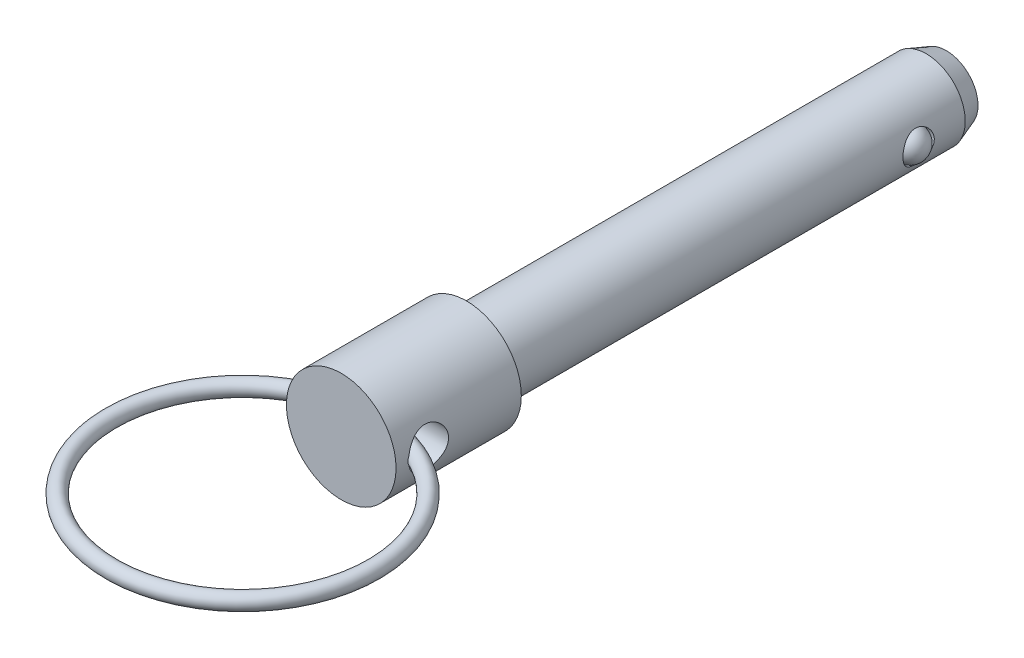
ISO-10303-21;
HEADER;
FILE_DESCRIPTION(('STEP AP214'),'2;1');
FILE_NAME('part.step','',(''),(''),'','','');
FILE_SCHEMA(('AUTOMOTIVE_DESIGN { 1 0 10303 214 1 1 1 1 }'));
ENDSEC;
DATA;
#1=APPLICATION_CONTEXT('core data for automotive mechanical design processes');
#2=APPLICATION_PROTOCOL_DEFINITION('international standard','automotive_design',2000,#1);
#3=PRODUCT_CONTEXT('',#1,'mechanical');
#4=PRODUCT('Part','Part','',(#3));
#5=PRODUCT_RELATED_PRODUCT_CATEGORY('part','',(#4));
#6=PRODUCT_DEFINITION_FORMATION('','',#4);
#7=PRODUCT_DEFINITION_CONTEXT('part definition',#1,'design');
#8=PRODUCT_DEFINITION('design','',#6,#7);
#9=PRODUCT_DEFINITION_SHAPE('','',#8);
#10=(LENGTH_UNIT() NAMED_UNIT(*) SI_UNIT(.MILLI.,.METRE.));
#11=(NAMED_UNIT(*) PLANE_ANGLE_UNIT() SI_UNIT($,.RADIAN.));
#12=(NAMED_UNIT(*) SI_UNIT($,.STERADIAN.) SOLID_ANGLE_UNIT());
#13=UNCERTAINTY_MEASURE_WITH_UNIT(LENGTH_MEASURE(1.E-05),#10,'distance_accuracy_value','');
#14=(GEOMETRIC_REPRESENTATION_CONTEXT(3) GLOBAL_UNCERTAINTY_ASSIGNED_CONTEXT((#13)) GLOBAL_UNIT_ASSIGNED_CONTEXT((#10,
#11,#12)) REPRESENTATION_CONTEXT('',''));
#15=CARTESIAN_POINT('',(0.,0.,0.));
#16=DIRECTION('',(0.,0.,1.));
#17=DIRECTION('',(1.,0.,0.));
#18=AXIS2_PLACEMENT_3D('',#15,#16,#17);
#19=CARTESIAN_POINT('',(7.9375,0.,9.398));
#20=DIRECTION('',(-1.,0.,0.));
#21=DIRECTION('',(0.,0.,-1.));
#22=AXIS2_PLACEMENT_3D('',#19,#20,#21);
#23=CYLINDRICAL_SURFACE('',#22,2.0193);
#24=CARTESIAN_POINT('',(-5.55645,0.413388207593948,11.3745329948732));
#25=CARTESIAN_POINT('',(-5.53323669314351,0.388835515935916,11.3796705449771));
#26=CARTESIAN_POINT('',(-5.51157389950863,0.362641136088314,11.3846690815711));
#27=CARTESIAN_POINT('',(-5.47216390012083,0.307044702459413,11.3940198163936));
#28=CARTESIAN_POINT('',(-5.45444977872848,0.277618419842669,11.3983664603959));
#29=CARTESIAN_POINT('',(-5.42406600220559,0.215851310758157,11.4059720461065));
#30=CARTESIAN_POINT('',(-5.41142802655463,0.18349367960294,11.4092241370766));
#31=CARTESIAN_POINT('',(-5.39235124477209,0.116986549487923,11.4141821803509));
#32=CARTESIAN_POINT('',(-5.38588919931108,0.0828442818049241,11.4158939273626));
#33=CARTESIAN_POINT('',(-5.37995615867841,0.017298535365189,11.4174656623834));
#34=CARTESIAN_POINT('',(-5.37986165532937,-0.0140451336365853,11.4174908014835));
#35=CARTESIAN_POINT('',(-5.38511249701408,-0.0762532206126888,11.4160995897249));
#36=CARTESIAN_POINT('',(-5.3904604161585,-0.107117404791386,11.4146825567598));
#37=CARTESIAN_POINT('',(-5.40574321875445,-0.165640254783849,11.4106965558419));
#38=CARTESIAN_POINT('',(-5.41539031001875,-0.193380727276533,11.408200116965));
#39=CARTESIAN_POINT('',(-5.43862859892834,-0.247073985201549,11.4023097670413));
#40=CARTESIAN_POINT('',(-5.45222392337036,-0.273024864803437,11.398914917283));
#41=CARTESIAN_POINT('',(-5.48024922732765,-0.318737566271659,11.3920973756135));
#42=CARTESIAN_POINT('',(-5.49418727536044,-0.338820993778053,11.3887682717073));
#43=CARTESIAN_POINT('',(-5.52397071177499,-0.37733037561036,11.3818282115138));
#44=CARTESIAN_POINT('',(-5.53980753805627,-0.395763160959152,11.378218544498));
#45=CARTESIAN_POINT('',(-5.55645,-0.413388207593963,11.3745329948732));
#46=B_SPLINE_CURVE_WITH_KNOTS('',3,(#24,#25,#26,#27,#28,#29,#30,#31,#32,#33,#34,#35,#36,#37,#38,
#39,#40,#41,#42,#43,#44,#45),.UNSPECIFIED.,.F.,.F.,(4,2,2,2,2,2,2,2,2,2,4),(0.,
0.102621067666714,0.206072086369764,0.310159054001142,0.413852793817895,0.50737645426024,
0.600944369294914,0.689017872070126,0.777183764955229,0.85106810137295,0.924630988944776),.UNSPECIFIED.);
#47=CARTESIAN_POINT('',(-5.54200209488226,0.397651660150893,11.3777589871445));
#48=VERTEX_POINT('',#47);
#49=CARTESIAN_POINT('',(-5.54200209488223,-0.397651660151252,11.3777589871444));
#50=VERTEX_POINT('',#49);
#51=EDGE_CURVE('E40',#48,#50,#46,.T.);
#52=ORIENTED_EDGE('',*,*,#51,.F.);
#53=CARTESIAN_POINT('',(-5.55625,0.,11.4173));
#54=CARTESIAN_POINT('',(-5.55624527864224,-0.109432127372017,11.4172937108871));
#55=CARTESIAN_POINT('',(-5.55298237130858,-0.218969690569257,11.408361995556));
#56=CARTESIAN_POINT('',(-5.54026368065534,-0.434902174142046,11.372953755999));
#57=CARTESIAN_POINT('',(-5.53079819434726,-0.541291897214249,11.3464497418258));
#58=CARTESIAN_POINT('',(-5.50670156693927,-0.747605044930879,11.2769560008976));
#59=CARTESIAN_POINT('',(-5.49208344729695,-0.847544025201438,11.2340078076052));
#60=CARTESIAN_POINT('',(-5.45915039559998,-1.03875753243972,11.1330083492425));
#61=CARTESIAN_POINT('',(-5.44083572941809,-1.13003268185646,11.0749581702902));
#62=CARTESIAN_POINT('',(-5.40158114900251,-1.30505728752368,10.9429422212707));
#63=CARTESIAN_POINT('',(-5.38056990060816,-1.38841141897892,10.8684736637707));
#64=CARTESIAN_POINT('',(-5.33865236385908,-1.54176439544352,10.7067995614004));
#65=CARTESIAN_POINT('',(-5.31774611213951,-1.61175885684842,10.6195898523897));
#66=CARTESIAN_POINT('',(-5.27759352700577,-1.73882919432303,10.4311528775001));
#67=CARTESIAN_POINT('',(-5.25843183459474,-1.79536185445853,10.3295394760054));
#68=CARTESIAN_POINT('',(-5.22503611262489,-1.89036141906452,10.1174402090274));
#69=CARTESIAN_POINT('',(-5.21080023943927,-1.92883508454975,10.0069576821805));
#70=CARTESIAN_POINT('',(-5.18962447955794,-1.98509166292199,9.78477737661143));
#71=CARTESIAN_POINT('',(-5.18242178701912,-2.00362275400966,9.67329490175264));
#72=CARTESIAN_POINT('',(-5.17535625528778,-2.02180769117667,9.44858805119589));
#73=CARTESIAN_POINT('',(-5.17549061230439,-2.02146874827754,9.33536435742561));
#74=CARTESIAN_POINT('',(-5.18285629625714,-2.00249790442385,9.11709454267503));
#75=CARTESIAN_POINT('',(-5.18969215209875,-1.98488533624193,9.01194405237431));
#76=CARTESIAN_POINT('',(-5.20903632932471,-1.93354575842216,8.80620743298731));
#77=CARTESIAN_POINT('',(-5.22154547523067,-1.89981640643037,8.70562196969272));
#78=CARTESIAN_POINT('',(-5.25107746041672,-1.81661001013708,8.5097235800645));
#79=CARTESIAN_POINT('',(-5.26817827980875,-1.76685762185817,8.41453987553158));
#80=CARTESIAN_POINT('',(-5.30493780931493,-1.65321144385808,8.23357336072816));
#81=CARTESIAN_POINT('',(-5.32459724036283,-1.58931366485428,8.14779321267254));
#82=CARTESIAN_POINT('',(-5.36576425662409,-1.44447059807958,7.98240722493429));
#83=CARTESIAN_POINT('',(-5.38731044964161,-1.36270785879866,7.90352531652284));
#84=CARTESIAN_POINT('',(-5.42876622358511,-1.18682967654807,7.76035905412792));
#85=CARTESIAN_POINT('',(-5.44867505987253,-1.09270866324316,7.69608131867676));
#86=CARTESIAN_POINT('',(-5.48497084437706,-0.893001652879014,7.58320896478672));
#87=CARTESIAN_POINT('',(-5.5013029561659,-0.787270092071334,7.53485348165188));
#88=CARTESIAN_POINT('',(-5.52817729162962,-0.568540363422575,7.45692936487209));
#89=CARTESIAN_POINT('',(-5.53873126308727,-0.455557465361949,7.4273225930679));
#90=CARTESIAN_POINT('',(-5.54924569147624,-0.284581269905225,7.39803699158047));
#91=CARTESIAN_POINT('',(-5.55186369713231,-0.227949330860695,7.3907957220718));
#92=CARTESIAN_POINT('',(-5.55536708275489,-0.114221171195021,7.3811255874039));
#93=CARTESIAN_POINT('',(-5.55625246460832,-0.0571249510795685,7.37869671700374));
#94=CARTESIAN_POINT('',(-5.55624527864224,0.10943212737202,7.37870628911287));
#95=CARTESIAN_POINT('',(-5.55298237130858,0.21896969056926,7.38763800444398));
#96=CARTESIAN_POINT('',(-5.54026368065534,0.434902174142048,7.42304624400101));
#97=CARTESIAN_POINT('',(-5.53079819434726,0.541291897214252,7.44955025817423));
#98=CARTESIAN_POINT('',(-5.50670156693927,0.747605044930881,7.51904399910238));
#99=CARTESIAN_POINT('',(-5.49208344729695,0.84754402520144,7.56199219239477));
#100=CARTESIAN_POINT('',(-5.45915039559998,1.03875753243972,7.66299165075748));
#101=CARTESIAN_POINT('',(-5.44083572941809,1.13003268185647,7.72104182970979));
#102=CARTESIAN_POINT('',(-5.40158114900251,1.30505728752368,7.85305777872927));
#103=CARTESIAN_POINT('',(-5.38056990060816,1.38841141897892,7.92752633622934));
#104=CARTESIAN_POINT('',(-5.33865236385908,1.54176439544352,8.08920043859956));
#105=CARTESIAN_POINT('',(-5.31774611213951,1.61175885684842,8.17641014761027));
#106=CARTESIAN_POINT('',(-5.27759352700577,1.73882919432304,8.36484712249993));
#107=CARTESIAN_POINT('',(-5.25843183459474,1.79536185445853,8.46646052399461));
#108=CARTESIAN_POINT('',(-5.22503611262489,1.89036141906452,8.67855979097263));
#109=CARTESIAN_POINT('',(-5.21080023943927,1.92883508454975,8.78904231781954));
#110=CARTESIAN_POINT('',(-5.18962447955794,1.98509166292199,9.01122262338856));
#111=CARTESIAN_POINT('',(-5.18242178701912,2.00362275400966,9.12270509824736));
#112=CARTESIAN_POINT('',(-5.17535625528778,2.02180769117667,9.34741194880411));
#113=CARTESIAN_POINT('',(-5.17549061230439,2.02146874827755,9.46063564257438));
#114=CARTESIAN_POINT('',(-5.18285629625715,2.00249790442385,9.67890545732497));
#115=CARTESIAN_POINT('',(-5.18969215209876,1.98488533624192,9.7840559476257));
#116=CARTESIAN_POINT('',(-5.20903632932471,1.93354575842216,9.98979256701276));
#117=CARTESIAN_POINT('',(-5.22154547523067,1.89981640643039,10.0903780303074));
#118=CARTESIAN_POINT('',(-5.25107746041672,1.81661001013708,10.2862764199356));
#119=CARTESIAN_POINT('',(-5.26817827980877,1.76685762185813,10.3814601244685));
#120=CARTESIAN_POINT('',(-5.30493780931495,1.65321144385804,10.5624266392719));
#121=CARTESIAN_POINT('',(-5.32459724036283,1.58931366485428,10.6482067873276));
#122=CARTESIAN_POINT('',(-5.36576425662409,1.44447059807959,10.8135927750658));
#123=CARTESIAN_POINT('',(-5.38731044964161,1.36270785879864,10.8924746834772));
#124=CARTESIAN_POINT('',(-5.42876622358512,1.18682967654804,11.0356409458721));
#125=CARTESIAN_POINT('',(-5.44867505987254,1.09270866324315,11.0999186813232));
#126=CARTESIAN_POINT('',(-5.48497084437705,0.89300165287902,11.2127910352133));
#127=CARTESIAN_POINT('',(-5.5013029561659,0.787270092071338,11.2611465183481));
#128=CARTESIAN_POINT('',(-5.52817729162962,0.56854036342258,11.3390706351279));
#129=CARTESIAN_POINT('',(-5.53873126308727,0.455557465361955,11.3686774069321));
#130=CARTESIAN_POINT('',(-5.54924569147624,0.284581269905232,11.3979630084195));
#131=CARTESIAN_POINT('',(-5.55186369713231,0.227949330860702,11.4052042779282));
#132=CARTESIAN_POINT('',(-5.55536708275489,0.114221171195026,11.4148744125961));
#133=CARTESIAN_POINT('',(-5.55625246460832,0.0571249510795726,11.4173032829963));
#134=CARTESIAN_POINT('',(-5.55625,0.,11.4173));
#135=B_SPLINE_CURVE_WITH_KNOTS('',3,(#53,#54,#55,#56,#57,#58,#59,#60,#61,#62,#63,#64,#65,#66,
#67,#68,#69,#70,#71,#72,#73,#74,#75,#76,#77,#78,#79,#80,#81,#82,#83,#84,#85,#86,#87,#88,#89,#90,
#91,#92,#93,#94,#95,#96,#97,#98,#99,#100,#101,#102,#103,#104,#105,#106,#107,#108,#109,#110,#111,
#112,#113,#114,#115,#116,#117,#118,#119,#120,#121,#122,#123,#124,#125,#126,#127,#128,#129,#130,
#131,#132,#133,#134),.UNSPECIFIED.,.T.,.F.,(4,2,2,2,2,2,2,2,2,2,2,2,2,2,2,2,2,2,2,2,2,2,2,2,2,2,
2,2,2,2,2,2,2,2,2,2,2,2,2,2,4),(0.,0.328075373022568,0.656665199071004,0.984430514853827,
1.31217226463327,1.65185430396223,1.99164760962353,2.3434350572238,2.69509069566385,
3.03303658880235,3.37085333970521,3.689865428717,4.00892389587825,4.33378721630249,
4.65874227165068,5.00406386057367,5.3495416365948,5.69999369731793,6.04973056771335,
6.22099023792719,6.39224972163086,6.72032509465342,7.04891492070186,7.37668023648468,
7.70442198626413,8.04410402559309,8.38389733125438,8.73568477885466,9.08734041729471,
9.4252863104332,9.76310306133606,10.0821151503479,10.4011736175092,10.7260369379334,
11.0509919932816,11.3963135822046,11.7417913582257,12.0922434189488,12.4419802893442,
12.6132399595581,12.7844994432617),.UNSPECIFIED.);
#136=EDGE_CURVE('E66',#50,#48,#135,.T.);
#137=ORIENTED_EDGE('',*,*,#136,.F.);
#138=EDGE_LOOP('',(#52,#137));
#139=FACE_BOUND('',#138,.T.);
#140=CARTESIAN_POINT('',(5.55645,-0.413388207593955,11.3745329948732));
#141=CARTESIAN_POINT('',(5.5332366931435,-0.38883551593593,11.3796705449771));
#142=CARTESIAN_POINT('',(5.51157389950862,-0.362641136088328,11.3846690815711));
#143=CARTESIAN_POINT('',(5.47216390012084,-0.307044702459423,11.3940198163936));
#144=CARTESIAN_POINT('',(5.4544497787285,-0.277618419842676,11.3983664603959));
#145=CARTESIAN_POINT('',(5.42406600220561,-0.215851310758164,11.4059720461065));
#146=CARTESIAN_POINT('',(5.41142802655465,-0.183493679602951,11.4092241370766));
#147=CARTESIAN_POINT('',(5.3923512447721,-0.116986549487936,11.4141821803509));
#148=CARTESIAN_POINT('',(5.3858891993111,-0.0828442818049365,11.4158939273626));
#149=CARTESIAN_POINT('',(5.37995615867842,-0.017298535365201,11.4174656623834));
#150=CARTESIAN_POINT('',(5.37986165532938,0.014045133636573,11.4174908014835));
#151=CARTESIAN_POINT('',(5.38511249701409,0.0762532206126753,11.4160995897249));
#152=CARTESIAN_POINT('',(5.39046041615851,0.107117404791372,11.4146825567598));
#153=CARTESIAN_POINT('',(5.40574321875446,0.165640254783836,11.4106965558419));
#154=CARTESIAN_POINT('',(5.41539031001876,0.193380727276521,11.408200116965));
#155=CARTESIAN_POINT('',(5.43862859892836,0.247073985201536,11.4023097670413));
#156=CARTESIAN_POINT('',(5.45222392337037,0.273024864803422,11.398914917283));
#157=CARTESIAN_POINT('',(5.48024922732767,0.318737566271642,11.3920973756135));
#158=CARTESIAN_POINT('',(5.49418727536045,0.338820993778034,11.3887682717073));
#159=CARTESIAN_POINT('',(5.523970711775,0.37733037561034,11.3818282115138));
#160=CARTESIAN_POINT('',(5.53980753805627,0.395763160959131,11.378218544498));
#161=CARTESIAN_POINT('',(5.55645,0.413388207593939,11.3745329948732));
#162=B_SPLINE_CURVE_WITH_KNOTS('',3,(#140,#141,#142,#143,#144,#145,#146,#147,#148,#149,#150,
#151,#152,#153,#154,#155,#156,#157,#158,#159,#160,#161),.UNSPECIFIED.,.F.,.F.,(4,2,2,2,2,2,2,2,
2,2,4),(0.,0.102621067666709,0.206072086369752,0.310159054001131,0.413852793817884,
0.507376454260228,0.600944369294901,0.689017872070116,0.777183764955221,0.851068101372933,
0.924630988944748),.UNSPECIFIED.);
#163=CARTESIAN_POINT('',(5.54200209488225,-0.397651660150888,11.3777589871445));
#164=VERTEX_POINT('',#163);
#165=CARTESIAN_POINT('',(5.54200209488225,0.397651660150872,11.3777589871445));
#166=VERTEX_POINT('',#165);
#167=EDGE_CURVE('E33',#164,#166,#162,.T.);
#168=ORIENTED_EDGE('',*,*,#167,.F.);
#169=CARTESIAN_POINT('',(5.55625,0.,7.3787));
#170=CARTESIAN_POINT('',(5.55624527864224,-0.109432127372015,7.37870628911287));
#171=CARTESIAN_POINT('',(5.55298237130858,-0.218969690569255,7.38763800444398));
#172=CARTESIAN_POINT('',(5.54026368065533,-0.434902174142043,7.42304624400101));
#173=CARTESIAN_POINT('',(5.53079819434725,-0.541291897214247,7.44955025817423));
#174=CARTESIAN_POINT('',(5.50670156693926,-0.747605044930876,7.51904399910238));
#175=CARTESIAN_POINT('',(5.49208344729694,-0.847544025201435,7.56199219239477));
#176=CARTESIAN_POINT('',(5.45915039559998,-1.03875753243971,7.66299165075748));
#177=CARTESIAN_POINT('',(5.44083572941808,-1.13003268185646,7.72104182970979));
#178=CARTESIAN_POINT('',(5.4015811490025,-1.30505728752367,7.85305777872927));
#179=CARTESIAN_POINT('',(5.38056990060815,-1.38841141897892,7.92752633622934));
#180=CARTESIAN_POINT('',(5.33865236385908,-1.54176439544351,8.08920043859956));
#181=CARTESIAN_POINT('',(5.31774611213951,-1.61175885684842,8.17641014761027));
#182=CARTESIAN_POINT('',(5.27759352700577,-1.73882919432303,8.36484712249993));
#183=CARTESIAN_POINT('',(5.25843183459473,-1.79536185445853,8.46646052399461));
#184=CARTESIAN_POINT('',(5.22503611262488,-1.89036141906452,8.67855979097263));
#185=CARTESIAN_POINT('',(5.21080023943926,-1.92883508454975,8.78904231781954));
#186=CARTESIAN_POINT('',(5.18962447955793,-1.98509166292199,9.01122262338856));
#187=CARTESIAN_POINT('',(5.18242178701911,-2.00362275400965,9.12270509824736));
#188=CARTESIAN_POINT('',(5.17535625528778,-2.02180769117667,9.34741194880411));
#189=CARTESIAN_POINT('',(5.17549061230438,-2.02146874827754,9.46063564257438));
#190=CARTESIAN_POINT('',(5.18285629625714,-2.00249790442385,9.67890545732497));
#191=CARTESIAN_POINT('',(5.18969215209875,-1.98488533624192,9.7840559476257));
#192=CARTESIAN_POINT('',(5.2090363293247,-1.93354575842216,9.98979256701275));
#193=CARTESIAN_POINT('',(5.22154547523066,-1.89981640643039,10.0903780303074));
#194=CARTESIAN_POINT('',(5.25107746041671,-1.81661001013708,10.2862764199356));
#195=CARTESIAN_POINT('',(5.26817827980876,-1.76685762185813,10.3814601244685));
#196=CARTESIAN_POINT('',(5.30493780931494,-1.65321144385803,10.5624266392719));
#197=CARTESIAN_POINT('',(5.32459724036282,-1.58931366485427,10.6482067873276));
#198=CARTESIAN_POINT('',(5.36576425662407,-1.44447059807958,10.8135927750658));
#199=CARTESIAN_POINT('',(5.3873104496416,-1.36270785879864,10.8924746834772));
#200=CARTESIAN_POINT('',(5.42876622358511,-1.18682967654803,11.0356409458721));
#201=CARTESIAN_POINT('',(5.44867505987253,-1.09270866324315,11.0999186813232));
#202=CARTESIAN_POINT('',(5.48497084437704,-0.893001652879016,11.2127910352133));
#203=CARTESIAN_POINT('',(5.50130295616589,-0.787270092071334,11.2611465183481));
#204=CARTESIAN_POINT('',(5.52817729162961,-0.568540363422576,11.3390706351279));
#205=CARTESIAN_POINT('',(5.53873126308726,-0.455557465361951,11.3686774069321));
#206=CARTESIAN_POINT('',(5.54924569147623,-0.284581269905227,11.3979630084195));
#207=CARTESIAN_POINT('',(5.5518636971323,-0.227949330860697,11.4052042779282));
#208=CARTESIAN_POINT('',(5.55536708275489,-0.114221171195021,11.4148744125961));
#209=CARTESIAN_POINT('',(5.55625246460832,-0.0571249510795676,11.4173032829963));
#210=CARTESIAN_POINT('',(5.55624527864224,0.109432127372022,11.4172937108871));
#211=CARTESIAN_POINT('',(5.55298237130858,0.218969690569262,11.408361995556));
#212=CARTESIAN_POINT('',(5.54026368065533,0.43490217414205,11.372953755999));
#213=CARTESIAN_POINT('',(5.53079819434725,0.541291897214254,11.3464497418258));
#214=CARTESIAN_POINT('',(5.50670156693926,0.747605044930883,11.2769560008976));
#215=CARTESIAN_POINT('',(5.49208344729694,0.847544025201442,11.2340078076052));
#216=CARTESIAN_POINT('',(5.45915039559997,1.03875753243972,11.1330083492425));
#217=CARTESIAN_POINT('',(5.44083572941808,1.13003268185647,11.0749581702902));
#218=CARTESIAN_POINT('',(5.4015811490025,1.30505728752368,10.9429422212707));
#219=CARTESIAN_POINT('',(5.38056990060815,1.38841141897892,10.8684736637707));
#220=CARTESIAN_POINT('',(5.33865236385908,1.54176439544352,10.7067995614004));
#221=CARTESIAN_POINT('',(5.31774611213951,1.61175885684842,10.6195898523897));
#222=CARTESIAN_POINT('',(5.27759352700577,1.73882919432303,10.4311528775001));
#223=CARTESIAN_POINT('',(5.25843183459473,1.79536185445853,10.3295394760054));
#224=CARTESIAN_POINT('',(5.22503611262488,1.89036141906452,10.1174402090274));
#225=CARTESIAN_POINT('',(5.21080023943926,1.92883508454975,10.0069576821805));
#226=CARTESIAN_POINT('',(5.18962447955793,1.98509166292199,9.78477737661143));
#227=CARTESIAN_POINT('',(5.18242178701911,2.00362275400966,9.67329490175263));
#228=CARTESIAN_POINT('',(5.17535625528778,2.02180769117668,9.44858805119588));
#229=CARTESIAN_POINT('',(5.17549061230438,2.02146874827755,9.33536435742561));
#230=CARTESIAN_POINT('',(5.18285629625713,2.00249790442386,9.11709454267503));
#231=CARTESIAN_POINT('',(5.18969215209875,1.98488533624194,9.01194405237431));
#232=CARTESIAN_POINT('',(5.2090363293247,1.93354575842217,8.80620743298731));
#233=CARTESIAN_POINT('',(5.22154547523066,1.89981640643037,8.70562196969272));
#234=CARTESIAN_POINT('',(5.25107746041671,1.81661001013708,8.5097235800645));
#235=CARTESIAN_POINT('',(5.26817827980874,1.76685762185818,8.41453987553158));
#236=CARTESIAN_POINT('',(5.30493780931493,1.65321144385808,8.23357336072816));
#237=CARTESIAN_POINT('',(5.32459724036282,1.58931366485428,8.14779321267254));
#238=CARTESIAN_POINT('',(5.36576425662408,1.44447059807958,7.98240722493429));
#239=CARTESIAN_POINT('',(5.3873104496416,1.36270785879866,7.90352531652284));
#240=CARTESIAN_POINT('',(5.4287662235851,1.18682967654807,7.76035905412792));
#241=CARTESIAN_POINT('',(5.44867505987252,1.09270866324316,7.69608131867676));
#242=CARTESIAN_POINT('',(5.48497084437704,0.893001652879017,7.58320896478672));
#243=CARTESIAN_POINT('',(5.50130295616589,0.787270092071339,7.53485348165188));
#244=CARTESIAN_POINT('',(5.52817729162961,0.568540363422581,7.45692936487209));
#245=CARTESIAN_POINT('',(5.53873126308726,0.455557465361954,7.4273225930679));
#246=CARTESIAN_POINT('',(5.54924569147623,0.284581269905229,7.39803699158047));
#247=CARTESIAN_POINT('',(5.5518636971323,0.2279493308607,7.3907957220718));
#248=CARTESIAN_POINT('',(5.55536708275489,0.114221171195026,7.3811255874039));
#249=CARTESIAN_POINT('',(5.55625246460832,0.0571249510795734,7.37869671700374));
#250=CARTESIAN_POINT('',(5.55625,0.,7.3787));
#251=B_SPLINE_CURVE_WITH_KNOTS('',3,(#169,#170,#171,#172,#173,#174,#175,#176,#177,#178,#179,
#180,#181,#182,#183,#184,#185,#186,#187,#188,#189,#190,#191,#192,#193,#194,#195,#196,#197,#198,
#199,#200,#201,#202,#203,#204,#205,#206,#207,#208,#209,#210,#211,#212,#213,#214,#215,#216,#217,
#218,#219,#220,#221,#222,#223,#224,#225,#226,#227,#228,#229,#230,#231,#232,#233,#234,#235,#236,
#237,#238,#239,#240,#241,#242,#243,#244,#245,#246,#247,#248,#249,#250),.UNSPECIFIED.,.T.,.F.,(4,
2,2,2,2,2,2,2,2,2,2,2,2,2,2,2,2,2,2,2,2,2,2,2,2,2,2,2,2,2,2,2,2,2,2,2,2,2,2,2,4),(0.,
0.328075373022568,0.656665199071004,0.984430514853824,1.31217226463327,1.65185430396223,
1.99164760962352,2.3434350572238,2.69509069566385,3.03303658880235,3.3708533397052,
3.68986542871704,4.00892389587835,4.33378721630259,4.65874227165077,5.00406386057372,
5.34954163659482,5.69999369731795,6.04973056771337,6.2209902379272,6.39224972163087,
6.72032509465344,7.04891492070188,7.3766802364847,7.70442198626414,8.04410402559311,
8.3838973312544,8.73568477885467,9.08734041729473,9.42528631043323,9.76310306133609,
10.0821151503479,10.4011736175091,10.7260369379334,11.0509919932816,11.3963135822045,
11.7417913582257,12.0922434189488,12.4419802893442,12.6132399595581,12.7844994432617),.UNSPECIFIED.);
#252=EDGE_CURVE('E62',#166,#164,#251,.T.);
#253=ORIENTED_EDGE('',*,*,#252,.F.);
#254=EDGE_LOOP('',(#168,#253));
#255=FACE_BOUND('',#254,.T.);
#256=ADVANCED_FACE('F14',(#139,#255),#23,.F.);
#257=CARTESIAN_POINT('',(0.,0.,-28.63596));
#258=DIRECTION('',(0.,0.,-1.));
#259=DIRECTION('',(1.,0.,0.));
#260=AXIS2_PLACEMENT_3D('',#257,#258,#259);
#261=CYLINDRICAL_SURFACE('',#260,5.55625);
#262=ORIENTED_EDGE('',*,*,#252,.T.);
#263=CARTESIAN_POINT('',(5.55009347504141,-0.261488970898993,9.7860840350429));
#264=CARTESIAN_POINT('',(5.54812529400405,-0.303251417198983,9.80096224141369));
#265=CARTESIAN_POINT('',(5.5457404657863,-0.343758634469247,9.81942005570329));
#266=CARTESIAN_POINT('',(5.54040847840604,-0.421066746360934,9.8629284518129));
#267=CARTESIAN_POINT('',(5.5374605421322,-0.457862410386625,9.88798816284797));
#268=CARTESIAN_POINT('',(5.53134134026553,-0.526658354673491,9.94386457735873));
#269=CARTESIAN_POINT('',(5.52817046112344,-0.558666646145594,9.97467146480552));
#270=CARTESIAN_POINT('',(5.52194469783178,-0.617178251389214,10.0411137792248));
#271=CARTESIAN_POINT('',(5.51888978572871,-0.643682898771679,10.0767480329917));
#272=CARTESIAN_POINT('',(5.51313628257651,-0.691254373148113,10.1527268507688));
#273=CARTESIAN_POINT('',(5.51044827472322,-0.712171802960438,10.1931655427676));
#274=CARTESIAN_POINT('',(5.50578097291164,-0.747399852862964,10.2768577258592));
#275=CARTESIAN_POINT('',(5.50380188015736,-0.761708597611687,10.3201120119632));
#276=CARTESIAN_POINT('',(5.50062483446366,-0.784334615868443,10.4110491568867));
#277=CARTESIAN_POINT('',(5.4994831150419,-0.792223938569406,10.4588401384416));
#278=CARTESIAN_POINT('',(5.49826873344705,-0.800607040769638,10.5550754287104));
#279=CARTESIAN_POINT('',(5.49819646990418,-0.801098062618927,10.6035199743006));
#280=CARTESIAN_POINT('',(5.49912806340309,-0.794680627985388,10.7039443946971));
#281=CARTESIAN_POINT('',(5.50022168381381,-0.787154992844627,10.7558841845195));
#282=CARTESIAN_POINT('',(5.50347103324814,-0.764103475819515,10.8579332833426));
#283=CARTESIAN_POINT('',(5.5056272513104,-0.748573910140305,10.9080417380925));
#284=CARTESIAN_POINT('',(5.51091051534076,-0.70866781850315,11.0082212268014));
#285=CARTESIAN_POINT('',(5.51408971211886,-0.683800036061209,11.0580951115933));
#286=CARTESIAN_POINT('',(5.52096808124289,-0.625839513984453,11.1528267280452));
#287=CARTESIAN_POINT('',(5.52466742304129,-0.592744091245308,11.1976828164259));
#288=CARTESIAN_POINT('',(5.53199718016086,-0.519831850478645,11.2794067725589));
#289=CARTESIAN_POINT('',(5.53562669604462,-0.480224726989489,11.3164602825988));
#290=CARTESIAN_POINT('',(5.54239660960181,-0.394450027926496,11.3820559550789));
#291=CARTESIAN_POINT('',(5.54553772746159,-0.348292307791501,11.4106107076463));
#292=CARTESIAN_POINT('',(5.55042537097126,-0.257766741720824,11.4537693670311));
#293=CARTESIAN_POINT('',(5.55230678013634,-0.214079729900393,11.4697807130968));
#294=CARTESIAN_POINT('',(5.55503790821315,-0.124373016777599,11.4927832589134));
#295=CARTESIAN_POINT('',(5.55588906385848,-0.0783566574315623,11.4997870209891));
#296=CARTESIAN_POINT('',(5.55638432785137,0.00705853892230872,11.5038718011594));
#297=CARTESIAN_POINT('',(5.55619261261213,0.0463971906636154,11.5023023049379));
#298=CARTESIAN_POINT('',(5.55499790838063,0.124194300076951,11.4923961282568));
#299=CARTESIAN_POINT('',(5.55399500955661,0.162652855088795,11.484060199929));
#300=CARTESIAN_POINT('',(5.55133569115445,0.236455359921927,11.4614747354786));
#301=CARTESIAN_POINT('',(5.54970019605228,0.271858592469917,11.4474138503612));
#302=CARTESIAN_POINT('',(5.54593788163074,0.340082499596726,11.414086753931));
#303=CARTESIAN_POINT('',(5.54381093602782,0.372902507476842,11.394819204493));
#304=CARTESIAN_POINT('',(5.53902830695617,0.438479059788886,11.3497412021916));
#305=CARTESIAN_POINT('',(5.53634134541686,0.470920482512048,11.3234773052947));
#306=CARTESIAN_POINT('',(5.5308403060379,0.53164948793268,11.2665410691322));
#307=CARTESIAN_POINT('',(5.52802616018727,0.559934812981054,11.2358663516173));
#308=CARTESIAN_POINT('',(5.52207389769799,0.616058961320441,11.1660010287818));
#309=CARTESIAN_POINT('',(5.51895184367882,0.643171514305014,11.1262251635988));
#310=CARTESIAN_POINT('',(5.5131400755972,0.691221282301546,11.0430715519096));
#311=CARTESIAN_POINT('',(5.51045062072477,0.712154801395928,10.9996916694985));
#312=CARTESIAN_POINT('',(5.50546631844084,0.749774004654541,10.9047684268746));
#313=CARTESIAN_POINT('',(5.5032620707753,0.765608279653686,10.8528805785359));
#314=CARTESIAN_POINT('',(5.49999925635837,0.788707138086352,10.7471802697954));
#315=CARTESIAN_POINT('',(5.49894104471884,0.795969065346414,10.693367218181));
#316=CARTESIAN_POINT('',(5.49812737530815,0.801573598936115,10.5836973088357));
#317=CARTESIAN_POINT('',(5.49841008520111,0.799654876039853,10.5278260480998));
#318=CARTESIAN_POINT('',(5.50039129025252,0.785912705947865,10.4173293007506));
#319=CARTESIAN_POINT('',(5.50208922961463,0.774093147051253,10.3627033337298));
#320=CARTESIAN_POINT('',(5.50657222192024,0.741502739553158,10.2600057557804));
#321=CARTESIAN_POINT('',(5.50928213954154,0.721341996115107,10.2117380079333));
#322=CARTESIAN_POINT('',(5.5154579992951,0.672487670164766,10.1197820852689));
#323=CARTESIAN_POINT('',(5.51892350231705,0.643799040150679,10.0760912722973));
#324=CARTESIAN_POINT('',(5.52582601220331,0.581424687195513,9.99852087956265));
#325=CARTESIAN_POINT('',(5.52923968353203,0.548383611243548,9.96412004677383));
#326=CARTESIAN_POINT('',(5.53588272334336,0.476663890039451,9.90178589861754));
#327=CARTESIAN_POINT('',(5.53911216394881,0.437987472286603,9.87385003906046));
#328=CARTESIAN_POINT('',(5.54480401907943,0.358545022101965,9.82683552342));
#329=CARTESIAN_POINT('',(5.54729992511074,0.318028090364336,9.80733901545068));
#330=CARTESIAN_POINT('',(5.55147034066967,0.234199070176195,9.7755782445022));
#331=CARTESIAN_POINT('',(5.55314476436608,0.190886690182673,9.76331473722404));
#332=CARTESIAN_POINT('',(5.55544526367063,0.103875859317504,9.74662090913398));
#333=CARTESIAN_POINT('',(5.55609634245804,0.0602137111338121,9.7420036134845));
#334=CARTESIAN_POINT('',(5.55635470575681,-0.0272293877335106,9.74015977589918));
#335=CARTESIAN_POINT('',(5.55596342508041,-0.0710100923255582,9.74292307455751));
#336=CARTESIAN_POINT('',(5.55456091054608,-0.139289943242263,9.75303365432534));
#337=CARTESIAN_POINT('',(5.55387840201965,-0.164176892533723,9.75797314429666));
#338=CARTESIAN_POINT('',(5.55220711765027,-0.213342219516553,9.77024669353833));
#339=CARTESIAN_POINT('',(5.55121834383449,-0.237620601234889,9.77758073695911));
#340=CARTESIAN_POINT('',(5.55009347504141,-0.261488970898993,9.7860840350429));
#341=B_SPLINE_CURVE_WITH_KNOTS('',3,(#263,#264,#265,#266,#267,#268,#269,#270,#271,#272,#273,
#274,#275,#276,#277,#278,#279,#280,#281,#282,#283,#284,#285,#286,#287,#288,#289,#290,#291,#292,
#293,#294,#295,#296,#297,#298,#299,#300,#301,#302,#303,#304,#305,#306,#307,#308,#309,#310,#311,
#312,#313,#314,#315,#316,#317,#318,#319,#320,#321,#322,#323,#324,#325,#326,#327,#328,#329,#330,
#331,#332,#333,#334,#335,#336,#337,#338,#339,#340),.UNSPECIFIED.,.T.,.F.,(4,2,2,2,2,2,2,2,2,2,2,
2,2,2,2,2,2,2,2,2,2,2,2,2,2,2,2,2,2,2,2,2,2,2,2,2,2,2,4),(0.,0.133035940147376,
0.266256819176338,0.399252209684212,0.532215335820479,0.668441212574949,0.804705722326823,
0.949444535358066,1.09423729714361,1.25104087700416,1.40791668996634,1.57457416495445,
1.74128605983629,1.90341673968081,2.06530602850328,2.20414603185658,2.34279219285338,
2.46030997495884,2.57781469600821,2.69172579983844,2.80566620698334,2.93066170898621,
3.05572486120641,3.19986521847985,3.34409161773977,3.50624490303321,3.66844841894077,
3.8352961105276,4.00207830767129,4.15836501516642,4.31456113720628,4.45728171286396,
4.59994602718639,4.73438372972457,4.86883547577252,4.99994808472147,5.13088030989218,
5.20691445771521,5.28294810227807),.UNSPECIFIED.);
#342=EDGE_CURVE('E27',#164,#166,#341,.T.);
#343=ORIENTED_EDGE('',*,*,#342,.T.);
#344=EDGE_LOOP('',(#262,#343));
#345=FACE_BOUND('',#344,.T.);
#346=CARTESIAN_POINT('',(0.,0.,-8.27046764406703E-11));
#347=DIRECTION('',(0.,0.,-1.));
#348=DIRECTION('',(1.,0.,0.));
#349=AXIS2_PLACEMENT_3D('',#346,#347,#348);
#350=CIRCLE('',#349,5.55625000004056);
#351=CARTESIAN_POINT('',(5.55625000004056,0.,-8.2704921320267E-11));
#352=VERTEX_POINT('',#351);
#353=EDGE_CURVE('E71',#352,#352,#350,.T.);
#354=ORIENTED_EDGE('',*,*,#353,.F.);
#355=EDGE_LOOP('',(#354));
#356=FACE_BOUND('',#355,.T.);
#357=CARTESIAN_POINT('',(0.,0.,12.7000000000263));
#358=DIRECTION('',(0.,0.,-1.));
#359=DIRECTION('',(1.,0.,0.));
#360=AXIS2_PLACEMENT_3D('',#357,#358,#359);
#361=CIRCLE('',#360,5.55625000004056);
#362=CARTESIAN_POINT('',(5.55625000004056,0.,12.7000000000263));
#363=VERTEX_POINT('',#362);
#364=EDGE_CURVE('E279',#363,#363,#361,.T.);
#365=ORIENTED_EDGE('',*,*,#364,.T.);
#366=EDGE_LOOP('',(#365));
#367=FACE_BOUND('',#366,.T.);
#368=ORIENTED_EDGE('',*,*,#136,.T.);
#369=CARTESIAN_POINT('',(-5.55009347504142,-0.26148897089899,9.786084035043));
#370=CARTESIAN_POINT('',(-5.55201952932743,-0.220600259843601,9.77152029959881));
#371=CARTESIAN_POINT('',(-5.55354800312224,-0.17846445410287,9.76037150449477));
#372=CARTESIAN_POINT('',(-5.5556384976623,-0.0928868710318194,9.74524129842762));
#373=CARTESIAN_POINT('',(-5.55620009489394,-0.0494445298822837,9.74126302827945));
#374=CARTESIAN_POINT('',(-5.55629347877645,0.0374935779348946,9.74059719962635));
#375=CARTESIAN_POINT('',(-5.55582538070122,0.0809893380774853,9.74390882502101));
#376=CARTESIAN_POINT('',(-5.55391173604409,0.166795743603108,9.75772411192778));
#377=CARTESIAN_POINT('',(-5.55246627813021,0.209106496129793,9.76822712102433));
#378=CARTESIAN_POINT('',(-5.54875885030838,0.291350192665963,9.79611251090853));
#379=CARTESIAN_POINT('',(-5.54649699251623,0.331283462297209,9.81349394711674));
#380=CARTESIAN_POINT('',(-5.54140563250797,0.407683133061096,9.85461863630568));
#381=CARTESIAN_POINT('',(-5.53857612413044,0.444149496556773,9.87836195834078));
#382=CARTESIAN_POINT('',(-5.53262152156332,0.513054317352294,9.93180289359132));
#383=CARTESIAN_POINT('',(-5.52949345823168,0.545442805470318,9.96156453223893));
#384=CARTESIAN_POINT('',(-5.52330278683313,0.604927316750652,10.0259730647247));
#385=CARTESIAN_POINT('',(-5.52024018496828,0.632022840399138,10.0606204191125));
#386=CARTESIAN_POINT('',(-5.51440051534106,0.68112664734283,10.1349305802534));
#387=CARTESIAN_POINT('',(-5.51163525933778,0.702950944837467,10.1747156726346));
#388=CARTESIAN_POINT('',(-5.50677513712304,0.74006277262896,10.2572565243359));
#389=CARTESIAN_POINT('',(-5.50468043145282,0.755348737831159,10.3000129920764));
#390=CARTESIAN_POINT('',(-5.50124315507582,0.780002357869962,10.3899815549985));
#391=CARTESIAN_POINT('',(-5.49995301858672,0.788961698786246,10.4373072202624));
#392=CARTESIAN_POINT('',(-5.498425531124,0.799536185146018,10.5327838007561));
#393=CARTESIAN_POINT('',(-5.49818856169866,0.801148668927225,10.580935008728));
#394=CARTESIAN_POINT('',(-5.49877665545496,0.797104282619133,10.6808979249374));
#395=CARTESIAN_POINT('',(-5.49969077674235,0.790837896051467,10.7326845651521));
#396=CARTESIAN_POINT('',(-5.50259820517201,0.770345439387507,10.8346351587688));
#397=CARTESIAN_POINT('',(-5.50459199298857,0.756115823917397,10.8847983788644));
#398=CARTESIAN_POINT('',(-5.50958513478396,0.718862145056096,10.9855133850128));
#399=CARTESIAN_POINT('',(-5.51264228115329,0.69531860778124,11.0358713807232));
#400=CARTESIAN_POINT('',(-5.51933971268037,0.639982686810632,11.1318512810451));
#401=CARTESIAN_POINT('',(-5.52298029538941,0.608186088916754,11.177470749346));
#402=CARTESIAN_POINT('',(-5.53030695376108,0.537456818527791,11.2614236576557));
#403=CARTESIAN_POINT('',(-5.53399100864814,0.498663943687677,11.2998741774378));
#404=CARTESIAN_POINT('',(-5.54094301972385,0.414294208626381,11.3684444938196));
#405=CARTESIAN_POINT('',(-5.54421186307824,0.368732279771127,11.3985822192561));
#406=CARTESIAN_POINT('',(-5.54902610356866,0.285409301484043,11.4415518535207));
#407=CARTESIAN_POINT('',(-5.55079831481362,0.24893103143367,11.4568629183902));
#408=CARTESIAN_POINT('',(-5.55365405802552,0.173909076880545,11.4812007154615));
#409=CARTESIAN_POINT('',(-5.55473812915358,0.135367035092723,11.4902323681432));
#410=CARTESIAN_POINT('',(-5.55609389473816,0.0571634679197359,11.5014913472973));
#411=CARTESIAN_POINT('',(-5.55636320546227,0.0174989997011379,11.5036987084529));
#412=CARTESIAN_POINT('',(-5.55604928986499,-0.0615987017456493,11.5011080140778));
#413=CARTESIAN_POINT('',(-5.55546601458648,-0.101031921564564,11.4963095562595));
#414=CARTESIAN_POINT('',(-5.55356355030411,-0.176675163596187,11.4803936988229));
#415=CARTESIAN_POINT('',(-5.55227928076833,-0.212950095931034,11.4695756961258));
#416=CARTESIAN_POINT('',(-5.54913333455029,-0.283330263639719,11.4424161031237));
#417=CARTESIAN_POINT('',(-5.54727154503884,-0.317435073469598,11.4260734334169));
#418=CARTESIAN_POINT('',(-5.54300097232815,-0.38507250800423,11.3872975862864));
#419=CARTESIAN_POINT('',(-5.54056357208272,-0.418407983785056,11.3645254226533));
#420=CARTESIAN_POINT('',(-5.53544762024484,-0.481387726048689,11.3143838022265));
#421=CARTESIAN_POINT('',(-5.53276895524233,-0.511030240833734,11.2870121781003));
#422=CARTESIAN_POINT('',(-5.52699292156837,-0.570330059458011,11.2242365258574));
#423=CARTESIAN_POINT('',(-5.52389129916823,-0.599362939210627,11.1882432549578));
#424=CARTESIAN_POINT('',(-5.51794192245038,-0.651866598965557,11.1123875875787));
#425=CARTESIAN_POINT('',(-5.51509432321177,-0.675333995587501,11.0725228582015));
#426=CARTESIAN_POINT('',(-5.50953849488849,-0.719347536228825,10.9840543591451));
#427=CARTESIAN_POINT('',(-5.50690598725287,-0.739020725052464,10.9350095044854));
#428=CARTESIAN_POINT('',(-5.50259788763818,-0.770442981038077,10.8343900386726));
#429=CARTESIAN_POINT('',(-5.50092272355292,-0.782188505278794,10.782814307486));
#430=CARTESIAN_POINT('',(-5.49868146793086,-0.797800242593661,10.6753545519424));
#431=CARTESIAN_POINT('',(-5.49818587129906,-0.801166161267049,10.6193948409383));
#432=CARTESIAN_POINT('',(-5.49862892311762,-0.798121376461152,10.5077343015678));
#433=CARTESIAN_POINT('',(-5.49956724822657,-0.79171287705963,10.452033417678));
#434=CARTESIAN_POINT('',(-5.5027408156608,-0.769336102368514,10.3451160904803));
#435=CARTESIAN_POINT('',(-5.50491833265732,-0.753792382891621,10.2938098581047));
#436=CARTESIAN_POINT('',(-5.51027934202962,-0.713544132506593,10.1949693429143));
#437=CARTESIAN_POINT('',(-5.51346234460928,-0.688844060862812,10.1474332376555));
#438=CARTESIAN_POINT('',(-5.52010275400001,-0.633315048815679,10.0619154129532));
#439=CARTESIAN_POINT('',(-5.52351228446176,-0.603205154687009,10.0234624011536));
#440=CARTESIAN_POINT('',(-5.53038590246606,-0.536527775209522,9.95266893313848));
#441=CARTESIAN_POINT('',(-5.53384993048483,-0.499966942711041,9.92032224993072));
#442=CARTESIAN_POINT('',(-5.53964550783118,-0.430319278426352,9.86936528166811));
#443=CARTESIAN_POINT('',(-5.54205683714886,-0.398291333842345,9.84930122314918));
#444=CARTESIAN_POINT('',(-5.54644342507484,-0.331652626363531,9.81399262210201));
#445=CARTESIAN_POINT('',(-5.54841874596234,-0.297042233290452,9.79874739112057));
#446=CARTESIAN_POINT('',(-5.55009347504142,-0.26148897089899,9.786084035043));
#447=B_SPLINE_CURVE_WITH_KNOTS('',3,(#369,#370,#371,#372,#373,#374,#375,#376,#377,#378,#379,
#380,#381,#382,#383,#384,#385,#386,#387,#388,#389,#390,#391,#392,#393,#394,#395,#396,#397,#398,
#399,#400,#401,#402,#403,#404,#405,#406,#407,#408,#409,#410,#411,#412,#413,#414,#415,#416,#417,
#418,#419,#420,#421,#422,#423,#424,#425,#426,#427,#428,#429,#430,#431,#432,#433,#434,#435,#436,
#437,#438,#439,#440,#441,#442,#443,#444,#445,#446),.UNSPECIFIED.,.T.,.F.,(4,2,2,2,2,2,2,2,2,2,2,
2,2,2,2,2,2,2,2,2,2,2,2,2,2,2,2,2,2,2,2,2,2,2,2,2,2,2,4),(0.,0.130208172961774,
0.260473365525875,0.390723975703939,0.520962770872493,0.651183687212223,0.781406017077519,
0.913094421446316,1.04479524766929,1.18058351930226,1.31640427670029,1.46034248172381,
1.60433282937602,1.76017982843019,1.91609626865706,2.08232629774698,2.24864137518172,
2.41194177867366,2.57488717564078,2.69318920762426,2.81139843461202,2.92995317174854,
3.04851471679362,3.16164747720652,3.27480235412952,3.39566347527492,3.5165817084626,
3.65508000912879,3.79366229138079,3.95170470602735,4.10981770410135,4.27716593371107,
4.44447643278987,4.60456550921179,4.76457672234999,4.91068415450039,5.05664177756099,
5.16987565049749,5.28309333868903),.UNSPECIFIED.);
#448=EDGE_CURVE('E9',#48,#50,#447,.T.);
#449=ORIENTED_EDGE('',*,*,#448,.T.);
#450=EDGE_LOOP('',(#368,#449));
#451=FACE_BOUND('',#450,.T.);
#452=ADVANCED_FACE('F64',(#345,#356,#367,#451),#261,.T.);
#453=CARTESIAN_POINT('',(0.,0.,-20.));
#454=DIRECTION('',(0.,0.,1.));
#455=DIRECTION('',(-0.810321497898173,-0.585985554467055,0.));
#456=AXIS2_PLACEMENT_3D('',#453,#454,#455);
#457=CYLINDRICAL_SURFACE('',#456,3.95605);
#458=CARTESIAN_POINT('',(0.,0.,0.));
#459=DIRECTION('',(0.,0.,-1.));
#460=DIRECTION('',(0.810321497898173,0.585985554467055,0.));
#461=AXIS2_PLACEMENT_3D('',#458,#459,#460);
#462=CIRCLE('',#461,3.95605);
#463=CARTESIAN_POINT('',(3.20567236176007,2.31818815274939,0.));
#464=VERTEX_POINT('',#463);
#465=EDGE_CURVE('E60',#464,#464,#462,.T.);
#466=ORIENTED_EDGE('',*,*,#465,.T.);
#467=EDGE_LOOP('',(#466));
#468=FACE_BOUND('',#467,.T.);
#469=CARTESIAN_POINT('',(3.95605,0.,-40.29206));
#470=CARTESIAN_POINT('',(3.95604605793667,0.0853977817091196,-40.2920649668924));
#471=CARTESIAN_POINT('',(3.95325565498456,0.170869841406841,-40.2989843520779));
#472=CARTESIAN_POINT('',(3.9423774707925,0.339330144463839,-40.3263965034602));
#473=CARTESIAN_POINT('',(3.93428211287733,0.422314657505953,-40.3469086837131));
#474=CARTESIAN_POINT('',(3.91366462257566,0.583199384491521,-40.4006392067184));
#475=CARTESIAN_POINT('',(3.90115492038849,0.661113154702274,-40.433821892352));
#476=CARTESIAN_POINT('',(3.8729359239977,0.810225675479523,-40.5117972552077));
#477=CARTESIAN_POINT('',(3.85722666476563,0.881424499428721,-40.5565898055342));
#478=CARTESIAN_POINT('',(3.82336924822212,1.01851810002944,-40.6587424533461));
#479=CARTESIAN_POINT('',(3.80514523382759,1.08405283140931,-40.716560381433));
#480=CARTESIAN_POINT('',(3.76865795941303,1.20479657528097,-40.8421520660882));
#481=CARTESIAN_POINT('',(3.75039468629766,1.26000131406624,-40.9099299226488));
#482=CARTESIAN_POINT('',(3.71498321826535,1.36096514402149,-41.0572149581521));
#483=CARTESIAN_POINT('',(3.69792187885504,1.40618899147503,-41.1371120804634));
#484=CARTESIAN_POINT('',(3.66804079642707,1.4823954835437,-41.3041669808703));
#485=CARTESIAN_POINT('',(3.65521908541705,1.51338473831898,-41.3913213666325));
#486=CARTESIAN_POINT('',(3.63608657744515,1.55877880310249,-41.5662662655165));
#487=CARTESIAN_POINT('',(3.62950564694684,1.57387516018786,-41.6538467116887));
#488=CARTESIAN_POINT('',(3.62281725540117,1.58921493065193,-41.8305259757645));
#489=CARTESIAN_POINT('',(3.62270658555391,1.58946570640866,-41.9196240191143));
#490=CARTESIAN_POINT('',(3.62874096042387,1.5756309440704,-42.0901463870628));
#491=CARTESIAN_POINT('',(3.63444787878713,1.5625494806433,-42.1716706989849));
#492=CARTESIAN_POINT('',(3.65073868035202,1.52409646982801,-42.3312515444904));
#493=CARTESIAN_POINT('',(3.66132342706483,1.49872274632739,-42.4093074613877));
#494=CARTESIAN_POINT('',(3.68641045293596,1.43592091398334,-42.5616270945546));
#495=CARTESIAN_POINT('',(3.70098859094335,1.39825636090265,-42.6357802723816));
#496=CARTESIAN_POINT('',(3.73239843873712,1.31210960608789,-42.7769845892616));
#497=CARTESIAN_POINT('',(3.74923090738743,1.26362375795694,-42.8440333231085));
#498=CARTESIAN_POINT('',(3.78484685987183,1.15278197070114,-42.9746131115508));
#499=CARTESIAN_POINT('',(3.80368030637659,1.08964096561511,-43.0374658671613));
#500=CARTESIAN_POINT('',(3.84007052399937,0.953493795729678,-43.1519268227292));
#501=CARTESIAN_POINT('',(3.85762667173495,0.880482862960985,-43.2035295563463));
#502=CARTESIAN_POINT('',(3.88993279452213,0.724712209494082,-43.2949292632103));
#503=CARTESIAN_POINT('',(3.9046174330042,0.641782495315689,-43.3344608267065));
#504=CARTESIAN_POINT('',(3.92901118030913,0.469788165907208,-43.3987196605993));
#505=CARTESIAN_POINT('',(3.93873025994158,0.380736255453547,-43.4234766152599));
#506=CARTESIAN_POINT('',(3.94891240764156,0.242349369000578,-43.4492066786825));
#507=CARTESIAN_POINT('',(3.95157915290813,0.194170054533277,-43.455890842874));
#508=CARTESIAN_POINT('',(3.95514906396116,0.0973352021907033,-43.4648188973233));
#509=CARTESIAN_POINT('',(3.95605224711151,0.0486796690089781,-43.4670628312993));
#510=CARTESIAN_POINT('',(3.95604605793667,-0.085397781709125,-43.4670550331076));
#511=CARTESIAN_POINT('',(3.95325565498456,-0.170869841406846,-43.4601356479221));
#512=CARTESIAN_POINT('',(3.9423774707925,-0.339330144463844,-43.4327234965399));
#513=CARTESIAN_POINT('',(3.93428211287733,-0.422314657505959,-43.4122113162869));
#514=CARTESIAN_POINT('',(3.91366462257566,-0.583199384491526,-43.3584807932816));
#515=CARTESIAN_POINT('',(3.90115492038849,-0.661113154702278,-43.325298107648));
#516=CARTESIAN_POINT('',(3.87293592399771,-0.810225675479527,-43.2473227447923));
#517=CARTESIAN_POINT('',(3.85722666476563,-0.881424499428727,-43.2025301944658));
#518=CARTESIAN_POINT('',(3.82336924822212,-1.01851810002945,-43.1003775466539));
#519=CARTESIAN_POINT('',(3.80514523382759,-1.08405283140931,-43.042559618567));
#520=CARTESIAN_POINT('',(3.76865795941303,-1.20479657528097,-42.9169679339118));
#521=CARTESIAN_POINT('',(3.75039468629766,-1.26000131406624,-42.8491900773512));
#522=CARTESIAN_POINT('',(3.71498321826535,-1.36096514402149,-42.7019050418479));
#523=CARTESIAN_POINT('',(3.69792187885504,-1.40618899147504,-42.6220079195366));
#524=CARTESIAN_POINT('',(3.66804079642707,-1.48239548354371,-42.4549530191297));
#525=CARTESIAN_POINT('',(3.65521908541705,-1.51338473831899,-42.3677986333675));
#526=CARTESIAN_POINT('',(3.63608657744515,-1.55877880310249,-42.1928537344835));
#527=CARTESIAN_POINT('',(3.62950564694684,-1.57387516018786,-42.1052732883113));
#528=CARTESIAN_POINT('',(3.62281725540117,-1.58921493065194,-41.9285940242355));
#529=CARTESIAN_POINT('',(3.62270658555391,-1.58946570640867,-41.8394959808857));
#530=CARTESIAN_POINT('',(3.62874096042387,-1.57563094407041,-41.6689736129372));
#531=CARTESIAN_POINT('',(3.63444787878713,-1.5625494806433,-41.5874493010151));
#532=CARTESIAN_POINT('',(3.65073868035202,-1.52409646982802,-41.4278684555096));
#533=CARTESIAN_POINT('',(3.66132342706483,-1.4987227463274,-41.3498125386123));
#534=CARTESIAN_POINT('',(3.68641045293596,-1.43592091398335,-41.1974929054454));
#535=CARTESIAN_POINT('',(3.70098859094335,-1.39825636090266,-41.1233397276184));
#536=CARTESIAN_POINT('',(3.73239843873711,-1.3121096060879,-40.9821354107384));
#537=CARTESIAN_POINT('',(3.74923090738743,-1.26362375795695,-40.9150866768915));
#538=CARTESIAN_POINT('',(3.78484685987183,-1.15278197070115,-40.7845068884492));
#539=CARTESIAN_POINT('',(3.80368030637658,-1.08964096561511,-40.7216541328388));
#540=CARTESIAN_POINT('',(3.84007052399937,-0.953493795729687,-40.6071931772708));
#541=CARTESIAN_POINT('',(3.85762667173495,-0.880482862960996,-40.5555904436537));
#542=CARTESIAN_POINT('',(3.88993279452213,-0.724712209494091,-40.4641907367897));
#543=CARTESIAN_POINT('',(3.9046174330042,-0.641782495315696,-40.4246591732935));
#544=CARTESIAN_POINT('',(3.92901118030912,-0.469788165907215,-40.3604003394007));
#545=CARTESIAN_POINT('',(3.93873025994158,-0.380736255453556,-40.3356433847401));
#546=CARTESIAN_POINT('',(3.94891240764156,-0.242349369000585,-40.3099133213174));
#547=CARTESIAN_POINT('',(3.95157915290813,-0.194170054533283,-40.303229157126));
#548=CARTESIAN_POINT('',(3.95514906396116,-0.0973352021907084,-40.2943011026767));
#549=CARTESIAN_POINT('',(3.95605224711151,-0.0486796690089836,-40.2920571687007));
#550=CARTESIAN_POINT('',(3.95605,0.,-40.29206));
#551=B_SPLINE_CURVE_WITH_KNOTS('',3,(#469,#470,#471,#472,#473,#474,#475,#476,#477,#478,#479,
#480,#481,#482,#483,#484,#485,#486,#487,#488,#489,#490,#491,#492,#493,#494,#495,#496,#497,#498,
#499,#500,#501,#502,#503,#504,#505,#506,#507,#508,#509,#510,#511,#512,#513,#514,#515,#516,#517,
#518,#519,#520,#521,#522,#523,#524,#525,#526,#527,#528,#529,#530,#531,#532,#533,#534,#535,#536,
#537,#538,#539,#540,#541,#542,#543,#544,#545,#546,#547,#548,#549,#550),.UNSPECIFIED.,.T.,.F.,(4,
2,2,2,2,2,2,2,2,2,2,2,2,2,2,2,2,2,2,2,2,2,2,2,2,2,2,2,2,2,2,2,2,2,2,2,2,2,2,2,4),(0.,
0.256004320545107,0.512375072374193,0.768029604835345,1.02368134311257,1.29033336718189,
1.55709546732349,1.83583223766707,2.11443943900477,2.38034753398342,2.64612375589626,
2.89326290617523,3.14044582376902,3.39269582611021,3.64503095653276,3.91697583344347,
4.18905255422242,4.46674016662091,4.74386797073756,4.88980066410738,5.0357319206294,
5.2917362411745,5.54810699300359,5.80376152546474,6.05941326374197,6.32606528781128,
6.59282738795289,6.87156415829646,7.15017135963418,7.41607945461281,7.68185567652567,
7.92899482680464,8.17617774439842,8.42842774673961,8.68076287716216,8.95270775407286,
9.22478447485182,9.50247208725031,9.77959989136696,9.92553258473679,10.0714638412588),.UNSPECIFIED.);
#552=CARTESIAN_POINT('',(3.95605,0.,-40.29206));
#553=VERTEX_POINT('',#552);
#554=EDGE_CURVE('E132',#553,#553,#551,.T.);
#555=ORIENTED_EDGE('',*,*,#554,.T.);
#556=EDGE_LOOP('',(#555));
#557=FACE_BOUND('',#556,.T.);
#558=CARTESIAN_POINT('',(0.,0.,-46.60396));
#559=DIRECTION('',(0.,0.,-1.));
#560=DIRECTION('',(-1.,0.,0.));
#561=AXIS2_PLACEMENT_3D('',#558,#559,#560);
#562=CIRCLE('',#561,3.95605);
#563=CARTESIAN_POINT('',(-3.95605,0.,-46.60396));
#564=VERTEX_POINT('',#563);
#565=EDGE_CURVE('E117',#564,#564,#562,.F.);
#566=ORIENTED_EDGE('',*,*,#565,.T.);
#567=EDGE_LOOP('',(#566));
#568=FACE_BOUND('',#567,.T.);
#569=CARTESIAN_POINT('',(-3.95605,0.,-43.46706));
#570=CARTESIAN_POINT('',(-3.95604605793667,0.0853977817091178,-43.4670550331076));
#571=CARTESIAN_POINT('',(-3.95325565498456,0.170869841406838,-43.4601356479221));
#572=CARTESIAN_POINT('',(-3.94237747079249,0.339330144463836,-43.4327234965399));
#573=CARTESIAN_POINT('',(-3.93428211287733,0.42231465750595,-43.4122113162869));
#574=CARTESIAN_POINT('',(-3.91366462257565,0.583199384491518,-43.3584807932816));
#575=CARTESIAN_POINT('',(-3.90115492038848,0.661113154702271,-43.325298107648));
#576=CARTESIAN_POINT('',(-3.8729359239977,0.81022567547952,-43.2473227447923));
#577=CARTESIAN_POINT('',(-3.85722666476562,0.881424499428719,-43.2025301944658));
#578=CARTESIAN_POINT('',(-3.82336924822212,1.01851810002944,-43.1003775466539));
#579=CARTESIAN_POINT('',(-3.80514523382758,1.08405283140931,-43.042559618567));
#580=CARTESIAN_POINT('',(-3.76865795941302,1.20479657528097,-42.9169679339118));
#581=CARTESIAN_POINT('',(-3.75039468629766,1.26000131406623,-42.8491900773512));
#582=CARTESIAN_POINT('',(-3.71498321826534,1.36096514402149,-42.7019050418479));
#583=CARTESIAN_POINT('',(-3.69792187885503,1.40618899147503,-42.6220079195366));
#584=CARTESIAN_POINT('',(-3.66804079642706,1.4823954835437,-42.4549530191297));
#585=CARTESIAN_POINT('',(-3.65521908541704,1.51338473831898,-42.3677986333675));
#586=CARTESIAN_POINT('',(-3.63608657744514,1.55877880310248,-42.1928537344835));
#587=CARTESIAN_POINT('',(-3.62950564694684,1.57387516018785,-42.1052732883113));
#588=CARTESIAN_POINT('',(-3.62281725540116,1.58921493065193,-41.9285940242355));
#589=CARTESIAN_POINT('',(-3.6227065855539,1.58946570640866,-41.8394959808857));
#590=CARTESIAN_POINT('',(-3.62874096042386,1.5756309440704,-41.6689736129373));
#591=CARTESIAN_POINT('',(-3.63444787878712,1.5625494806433,-41.5874493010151));
#592=CARTESIAN_POINT('',(-3.65073868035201,1.52409646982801,-41.4278684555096));
#593=CARTESIAN_POINT('',(-3.66132342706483,1.49872274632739,-41.3498125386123));
#594=CARTESIAN_POINT('',(-3.68641045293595,1.43592091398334,-41.1974929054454));
#595=CARTESIAN_POINT('',(-3.70098859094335,1.39825636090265,-41.1233397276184));
#596=CARTESIAN_POINT('',(-3.73239843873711,1.31210960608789,-40.9821354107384));
#597=CARTESIAN_POINT('',(-3.74923090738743,1.26362375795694,-40.9150866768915));
#598=CARTESIAN_POINT('',(-3.78484685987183,1.15278197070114,-40.7845068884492));
#599=CARTESIAN_POINT('',(-3.80368030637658,1.0896409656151,-40.7216541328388));
#600=CARTESIAN_POINT('',(-3.84007052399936,0.953493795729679,-40.6071931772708));
#601=CARTESIAN_POINT('',(-3.85762667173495,0.880482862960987,-40.5555904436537));
#602=CARTESIAN_POINT('',(-3.88993279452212,0.724712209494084,-40.4641907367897));
#603=CARTESIAN_POINT('',(-3.90461743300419,0.641782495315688,-40.4246591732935));
#604=CARTESIAN_POINT('',(-3.92901118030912,0.469788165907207,-40.3604003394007));
#605=CARTESIAN_POINT('',(-3.93873025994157,0.380736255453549,-40.3356433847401));
#606=CARTESIAN_POINT('',(-3.94891240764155,0.242349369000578,-40.3099133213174));
#607=CARTESIAN_POINT('',(-3.95157915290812,0.194170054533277,-40.303229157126));
#608=CARTESIAN_POINT('',(-3.95514906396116,0.0973352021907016,-40.2943011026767));
#609=CARTESIAN_POINT('',(-3.95605224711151,0.0486796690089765,-40.2920571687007));
#610=CARTESIAN_POINT('',(-3.95604605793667,-0.0853977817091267,-40.2920649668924));
#611=CARTESIAN_POINT('',(-3.95325565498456,-0.170869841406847,-40.2989843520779));
#612=CARTESIAN_POINT('',(-3.94237747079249,-0.339330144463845,-40.3263965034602));
#613=CARTESIAN_POINT('',(-3.93428211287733,-0.422314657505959,-40.3469086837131));
#614=CARTESIAN_POINT('',(-3.91366462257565,-0.583199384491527,-40.4006392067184));
#615=CARTESIAN_POINT('',(-3.90115492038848,-0.66111315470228,-40.433821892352));
#616=CARTESIAN_POINT('',(-3.8729359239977,-0.81022567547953,-40.5117972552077));
#617=CARTESIAN_POINT('',(-3.85722666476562,-0.881424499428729,-40.5565898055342));
#618=CARTESIAN_POINT('',(-3.82336924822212,-1.01851810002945,-40.6587424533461));
#619=CARTESIAN_POINT('',(-3.80514523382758,-1.08405283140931,-40.716560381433));
#620=CARTESIAN_POINT('',(-3.76865795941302,-1.20479657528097,-40.8421520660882));
#621=CARTESIAN_POINT('',(-3.75039468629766,-1.26000131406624,-40.9099299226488));
#622=CARTESIAN_POINT('',(-3.71498321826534,-1.3609651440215,-41.0572149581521));
#623=CARTESIAN_POINT('',(-3.69792187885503,-1.40618899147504,-41.1371120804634));
#624=CARTESIAN_POINT('',(-3.66804079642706,-1.48239548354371,-41.3041669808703));
#625=CARTESIAN_POINT('',(-3.65521908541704,-1.51338473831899,-41.3913213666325));
#626=CARTESIAN_POINT('',(-3.63608657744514,-1.5587788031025,-41.5662662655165));
#627=CARTESIAN_POINT('',(-3.62950564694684,-1.57387516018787,-41.6538467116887));
#628=CARTESIAN_POINT('',(-3.62281725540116,-1.58921493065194,-41.8305259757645));
#629=CARTESIAN_POINT('',(-3.6227065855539,-1.58946570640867,-41.9196240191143));
#630=CARTESIAN_POINT('',(-3.62874096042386,-1.57563094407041,-42.0901463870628));
#631=CARTESIAN_POINT('',(-3.63444787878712,-1.5625494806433,-42.1716706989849));
#632=CARTESIAN_POINT('',(-3.65073868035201,-1.52409646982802,-42.3312515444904));
#633=CARTESIAN_POINT('',(-3.66132342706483,-1.4987227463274,-42.4093074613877));
#634=CARTESIAN_POINT('',(-3.68641045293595,-1.43592091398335,-42.5616270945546));
#635=CARTESIAN_POINT('',(-3.70098859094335,-1.39825636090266,-42.6357802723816));
#636=CARTESIAN_POINT('',(-3.73239843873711,-1.3121096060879,-42.7769845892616));
#637=CARTESIAN_POINT('',(-3.74923090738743,-1.26362375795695,-42.8440333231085));
#638=CARTESIAN_POINT('',(-3.78484685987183,-1.15278197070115,-42.9746131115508));
#639=CARTESIAN_POINT('',(-3.80368030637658,-1.08964096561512,-43.0374658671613));
#640=CARTESIAN_POINT('',(-3.84007052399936,-0.953493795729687,-43.1519268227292));
#641=CARTESIAN_POINT('',(-3.85762667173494,-0.880482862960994,-43.2035295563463));
#642=CARTESIAN_POINT('',(-3.88993279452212,-0.724712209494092,-43.2949292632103));
#643=CARTESIAN_POINT('',(-3.90461743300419,-0.6417824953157,-43.3344608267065));
#644=CARTESIAN_POINT('',(-3.92901118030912,-0.46978816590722,-43.3987196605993));
#645=CARTESIAN_POINT('',(-3.93873025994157,-0.380736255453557,-43.4234766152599));
#646=CARTESIAN_POINT('',(-3.94891240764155,-0.242349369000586,-43.4492066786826));
#647=CARTESIAN_POINT('',(-3.95157915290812,-0.194170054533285,-43.455890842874));
#648=CARTESIAN_POINT('',(-3.95514906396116,-0.0973352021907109,-43.4648188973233));
#649=CARTESIAN_POINT('',(-3.95605224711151,-0.0486796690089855,-43.4670628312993));
#650=CARTESIAN_POINT('',(-3.95605,0.,-43.46706));
#651=B_SPLINE_CURVE_WITH_KNOTS('',3,(#569,#570,#571,#572,#573,#574,#575,#576,#577,#578,#579,
#580,#581,#582,#583,#584,#585,#586,#587,#588,#589,#590,#591,#592,#593,#594,#595,#596,#597,#598,
#599,#600,#601,#602,#603,#604,#605,#606,#607,#608,#609,#610,#611,#612,#613,#614,#615,#616,#617,
#618,#619,#620,#621,#622,#623,#624,#625,#626,#627,#628,#629,#630,#631,#632,#633,#634,#635,#636,
#637,#638,#639,#640,#641,#642,#643,#644,#645,#646,#647,#648,#649,#650),.UNSPECIFIED.,.T.,.F.,(4,
2,2,2,2,2,2,2,2,2,2,2,2,2,2,2,2,2,2,2,2,2,2,2,2,2,2,2,2,2,2,2,2,2,2,2,2,2,2,2,4),(0.,
0.256004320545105,0.512375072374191,0.768029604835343,1.02368134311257,1.29033336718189,
1.5570954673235,1.83583223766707,2.11443943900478,2.38034753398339,2.64612375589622,
2.89326290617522,3.14044582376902,3.39269582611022,3.64503095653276,3.91697583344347,
4.18905255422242,4.46674016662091,4.74386797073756,4.88980066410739,5.0357319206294,
5.29173624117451,5.54810699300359,5.80376152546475,6.05941326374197,6.32606528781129,
6.59282738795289,6.87156415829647,7.15017135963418,7.41607945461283,7.68185567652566,
7.92899482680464,8.17617774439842,8.42842774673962,8.68076287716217,8.95270775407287,
9.22478447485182,9.50247208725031,9.77959989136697,9.92553258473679,10.0714638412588),.UNSPECIFIED.);
#652=CARTESIAN_POINT('',(-3.95605,0.,-43.46706));
#653=VERTEX_POINT('',#652);
#654=EDGE_CURVE('E141',#653,#653,#651,.T.);
#655=ORIENTED_EDGE('',*,*,#654,.T.);
#656=EDGE_LOOP('',(#655));
#657=FACE_BOUND('',#656,.T.);
#658=ADVANCED_FACE('F16',(#468,#557,#568,#657),#457,.T.);
#659=CARTESIAN_POINT('',(0.,-5.30225,12.7));
#660=DIRECTION('',(0.,0.,1.));
#661=DIRECTION('',(-1.,0.,0.));
#662=AXIS2_PLACEMENT_3D('',#659,#660,#661);
#663=PLANE('',#662);
#664=ORIENTED_EDGE('',*,*,#364,.F.);
#665=EDGE_LOOP('',(#664));
#666=FACE_BOUND('',#665,.T.);
#667=ADVANCED_FACE('F150',(#666),#663,.T.);
#668=CARTESIAN_POINT('',(0.,-3.95605,0.));
#669=DIRECTION('',(0.,0.,-1.));
#670=DIRECTION('',(1.,0.,0.));
#671=AXIS2_PLACEMENT_3D('',#668,#669,#670);
#672=PLANE('',#671);
#673=ORIENTED_EDGE('',*,*,#353,.T.);
#674=EDGE_LOOP('',(#673));
#675=FACE_BOUND('',#674,.T.);
#676=ORIENTED_EDGE('',*,*,#465,.F.);
#677=EDGE_LOOP('',(#676));
#678=FACE_BOUND('',#677,.T.);
#679=ADVANCED_FACE('F86',(#675,#678),#672,.T.);
#680=CARTESIAN_POINT('',(-3.0861,0.,-41.87956));
#681=DIRECTION('',(0.,0.,-1.));
#682=DIRECTION('',(1.,0.,0.));
#683=AXIS2_PLACEMENT_3D('',#680,#681,#682);
#684=SPHERICAL_SURFACE('',#683,1.5875);
#685=CARTESIAN_POINT('',(-3.0861,0.,-41.87956));
#686=DIRECTION('',(1.,0.,0.));
#687=DIRECTION('',(0.,0.,-1.));
#688=AXIS2_PLACEMENT_3D('',#685,#686,#687);
#689=CIRCLE('',#688,1.5875);
#690=CARTESIAN_POINT('',(-3.0861,0.,-43.46706));
#691=VERTEX_POINT('',#690);
#692=CARTESIAN_POINT('',(-3.0861,0.,-40.29206));
#693=VERTEX_POINT('',#692);
#694=EDGE_CURVE('E112',#691,#693,#689,.F.);
#695=ORIENTED_EDGE('',*,*,#694,.T.);
#696=CARTESIAN_POINT('',(-3.0861,0.,-41.87956));
#697=DIRECTION('',(1.,0.,0.));
#698=DIRECTION('',(0.,0.,-1.));
#699=AXIS2_PLACEMENT_3D('',#696,#697,#698);
#700=CIRCLE('',#699,1.5875);
#701=EDGE_CURVE('E140',#693,#691,#700,.F.);
#702=ORIENTED_EDGE('',*,*,#701,.T.);
#703=EDGE_LOOP('',(#695,#702));
#704=FACE_BOUND('',#703,.T.);
#705=ADVANCED_FACE('F120',(#704),#684,.T.);
#706=CARTESIAN_POINT('',(0.,0.,-48.63596));
#707=DIRECTION('',(0.,0.,-1.));
#708=DIRECTION('',(-1.,0.,0.));
#709=AXIS2_PLACEMENT_3D('',#706,#707,#708);
#710=PLANE('',#709);
#711=CARTESIAN_POINT('',(0.,0.,-48.6359599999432));
#712=DIRECTION('',(0.,0.,1.));
#713=DIRECTION('',(1.,0.,0.));
#714=AXIS2_PLACEMENT_3D('',#711,#712,#713);
#715=CIRCLE('',#714,3.21646248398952);
#716=CARTESIAN_POINT('',(3.21646248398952,0.,-48.6359599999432));
#717=VERTEX_POINT('',#716);
#718=EDGE_CURVE('E146',#717,#717,#715,.T.);
#719=ORIENTED_EDGE('',*,*,#718,.F.);
#720=EDGE_LOOP('',(#719));
#721=FACE_BOUND('',#720,.T.);
#722=ADVANCED_FACE('F123',(#721),#710,.T.);
#723=CARTESIAN_POINT('',(3.0861,0.,-41.87956));
#724=DIRECTION('',(0.,0.,1.));
#725=DIRECTION('',(1.,0.,0.));
#726=AXIS2_PLACEMENT_3D('',#723,#724,#725);
#727=SPHERICAL_SURFACE('',#726,1.5875);
#728=CARTESIAN_POINT('',(3.0861,0.,-41.87956));
#729=DIRECTION('',(1.,0.,0.));
#730=DIRECTION('',(0.,0.,-1.));
#731=AXIS2_PLACEMENT_3D('',#728,#729,#730);
#732=CIRCLE('',#731,1.5875);
#733=CARTESIAN_POINT('',(3.0861,0.,-43.46706));
#734=VERTEX_POINT('',#733);
#735=CARTESIAN_POINT('',(3.0861,0.,-40.29206));
#736=VERTEX_POINT('',#735);
#737=EDGE_CURVE('E255',#734,#736,#732,.T.);
#738=ORIENTED_EDGE('',*,*,#737,.T.);
#739=CARTESIAN_POINT('',(3.0861,0.,-41.87956));
#740=DIRECTION('',(1.,0.,0.));
#741=DIRECTION('',(0.,0.,-1.));
#742=AXIS2_PLACEMENT_3D('',#739,#740,#741);
#743=CIRCLE('',#742,1.5875);
#744=EDGE_CURVE('E257',#736,#734,#743,.T.);
#745=ORIENTED_EDGE('',*,*,#744,.T.);
#746=EDGE_LOOP('',(#738,#745));
#747=FACE_BOUND('',#746,.T.);
#748=ADVANCED_FACE('F97',(#747),#727,.T.);
#749=CARTESIAN_POINT('',(-4.7625,0.,-41.87956));
#750=DIRECTION('',(1.,0.,0.));
#751=DIRECTION('',(0.,0.,-1.));
#752=AXIS2_PLACEMENT_3D('',#749,#750,#751);
#753=CYLINDRICAL_SURFACE('',#752,1.5875);
#754=ORIENTED_EDGE('',*,*,#654,.F.);
#755=EDGE_LOOP('',(#754));
#756=FACE_BOUND('',#755,.T.);
#757=ORIENTED_EDGE('',*,*,#694,.F.);
#758=ORIENTED_EDGE('',*,*,#701,.F.);
#759=EDGE_LOOP('',(#757,#758));
#760=FACE_BOUND('',#759,.T.);
#761=ADVANCED_FACE('F148',(#756,#760),#753,.F.);
#762=CARTESIAN_POINT('',(0.,0.,-46.6039600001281));
#763=DIRECTION('',(0.,0.,1.));
#764=DIRECTION('',(1.,0.,0.));
#765=AXIS2_PLACEMENT_3D('',#762,#763,#764);
#766=CONICAL_SURFACE('',#765,3.95604999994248,0.349065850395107);
#767=ORIENTED_EDGE('',*,*,#565,.F.);
#768=EDGE_LOOP('',(#767));
#769=FACE_BOUND('',#768,.T.);
#770=ORIENTED_EDGE('',*,*,#718,.T.);
#771=EDGE_LOOP('',(#770));
#772=FACE_BOUND('',#771,.T.);
#773=ADVANCED_FACE('F128',(#769,#772),#766,.T.);
#774=CARTESIAN_POINT('',(-4.7625,0.,-41.87956));
#775=DIRECTION('',(1.,0.,0.));
#776=DIRECTION('',(0.,0.,-1.));
#777=AXIS2_PLACEMENT_3D('',#774,#775,#776);
#778=CYLINDRICAL_SURFACE('',#777,1.5875);
#779=ORIENTED_EDGE('',*,*,#737,.F.);
#780=ORIENTED_EDGE('',*,*,#744,.F.);
#781=EDGE_LOOP('',(#779,#780));
#782=FACE_BOUND('',#781,.T.);
#783=ORIENTED_EDGE('',*,*,#554,.F.);
#784=EDGE_LOOP('',(#783));
#785=FACE_BOUND('',#784,.T.);
#786=ADVANCED_FACE('F96',(#782,#785),#778,.F.);
#787=CARTESIAN_POINT('',(0.,0.,22.7000000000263));
#788=DIRECTION('',(0.,1.,0.));
#789=DIRECTION('',(0.,0.,1.));
#790=AXIS2_PLACEMENT_3D('',#787,#788,#789);
#791=TOROIDAL_SURFACE('',#790,13.3,0.8);
#792=ORIENTED_EDGE('',*,*,#342,.F.);
#793=ORIENTED_EDGE('',*,*,#167,.T.);
#794=EDGE_LOOP('',(#792,#793));
#795=FACE_BOUND('',#794,.T.);
#796=ORIENTED_EDGE('',*,*,#448,.F.);
#797=ORIENTED_EDGE('',*,*,#51,.T.);
#798=EDGE_LOOP('',(#796,#797));
#799=FACE_BOUND('',#798,.T.);
#800=ADVANCED_FACE('F56',(#795,#799),#791,.T.);
#801=CLOSED_SHELL('',(#256,#452,#658,#667,#679,#705,#722,#748,#761,#773,#786,#800));
#802=MANIFOLD_SOLID_BREP('B1',#801);
#803=ADVANCED_BREP_SHAPE_REPRESENTATION('',(#18,#802),#14);
#804=SHAPE_DEFINITION_REPRESENTATION(#9,#803);
ENDSEC;
END-ISO-10303-21;
